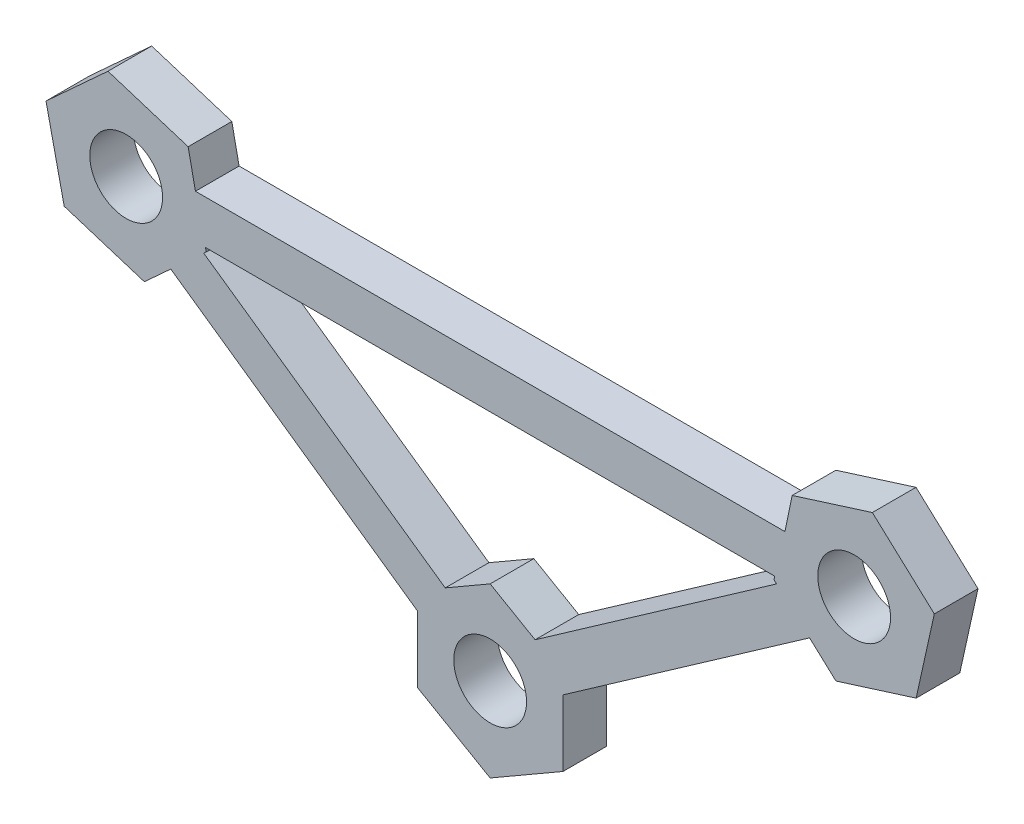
ISO-10303-21;
HEADER;
FILE_DESCRIPTION(('STEP AP214'),'2;1');
FILE_NAME('part.step','',(''),(''),'','','');
FILE_SCHEMA(('AUTOMOTIVE_DESIGN { 1 0 10303 214 1 1 1 1 }'));
ENDSEC;
DATA;
#1=APPLICATION_CONTEXT('core data for automotive mechanical design processes');
#2=APPLICATION_PROTOCOL_DEFINITION('international standard','automotive_design',2000,#1);
#3=PRODUCT_CONTEXT('',#1,'mechanical');
#4=PRODUCT('Part','Part','',(#3));
#5=PRODUCT_RELATED_PRODUCT_CATEGORY('part','',(#4));
#6=PRODUCT_DEFINITION_FORMATION('','',#4);
#7=PRODUCT_DEFINITION_CONTEXT('part definition',#1,'design');
#8=PRODUCT_DEFINITION('design','',#6,#7);
#9=PRODUCT_DEFINITION_SHAPE('','',#8);
#10=(LENGTH_UNIT() NAMED_UNIT(*) SI_UNIT(.MILLI.,.METRE.));
#11=(NAMED_UNIT(*) PLANE_ANGLE_UNIT() SI_UNIT($,.RADIAN.));
#12=(NAMED_UNIT(*) SI_UNIT($,.STERADIAN.) SOLID_ANGLE_UNIT());
#13=UNCERTAINTY_MEASURE_WITH_UNIT(LENGTH_MEASURE(1.E-05),#10,'distance_accuracy_value','');
#14=(GEOMETRIC_REPRESENTATION_CONTEXT(3) GLOBAL_UNCERTAINTY_ASSIGNED_CONTEXT((#13)) GLOBAL_UNIT_ASSIGNED_CONTEXT((#10,
#11,#12)) REPRESENTATION_CONTEXT('',''));
#15=CARTESIAN_POINT('',(0.,0.,0.));
#16=DIRECTION('',(0.,0.,1.));
#17=DIRECTION('',(1.,0.,0.));
#18=AXIS2_PLACEMENT_3D('',#15,#16,#17);
#19=CARTESIAN_POINT('',(-16.8800705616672,-4.00350123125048,1.5));
#20=DIRECTION('',(0.973007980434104,0.230771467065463,0.));
#21=DIRECTION('',(-0.230771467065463,0.973007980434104,0.));
#22=AXIS2_PLACEMENT_3D('',#19,#20,#21);
#23=PLANE('',#22);
#24=DIRECTION('',(0.230771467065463,-0.973007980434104,0.));
#25=VECTOR('',#24,1.);
#26=CARTESIAN_POINT('',(-16.8800705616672,-4.00350123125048,-1.5));
#27=LINE('',#26,#25);
#28=CARTESIAN_POINT('',(-19.5497153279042,7.25259422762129,-1.5));
#29=VERTEX_POINT('',#28);
#30=CARTESIAN_POINT('',(-19.493712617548,7.01646848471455,-1.5));
#31=VERTEX_POINT('',#30);
#32=EDGE_CURVE('E335',#29,#31,#27,.T.);
#33=ORIENTED_EDGE('',*,*,#32,.F.);
#34=DIRECTION('',(0.,0.,-1.));
#35=VECTOR('',#34,1.);
#36=CARTESIAN_POINT('',(-19.5497153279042,7.25259422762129,1.5));
#37=LINE('',#36,#35);
#38=CARTESIAN_POINT('',(-19.5497153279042,7.25259422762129,1.5));
#39=VERTEX_POINT('',#38);
#40=EDGE_CURVE('E11',#39,#29,#37,.T.);
#41=ORIENTED_EDGE('',*,*,#40,.F.);
#42=DIRECTION('',(0.230771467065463,-0.973007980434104,0.));
#43=VECTOR('',#42,1.);
#44=CARTESIAN_POINT('',(-16.8800705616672,-4.00350123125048,1.5));
#45=LINE('',#44,#43);
#46=CARTESIAN_POINT('',(-19.493712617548,7.01646848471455,1.5));
#47=VERTEX_POINT('',#46);
#48=EDGE_CURVE('E416',#39,#47,#45,.T.);
#49=ORIENTED_EDGE('',*,*,#48,.T.);
#50=DIRECTION('',(0.,0.,-1.));
#51=VECTOR('',#50,1.);
#52=CARTESIAN_POINT('',(-19.493712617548,7.01646848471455,1.5));
#53=LINE('',#52,#51);
#54=EDGE_CURVE('E151',#47,#31,#53,.T.);
#55=ORIENTED_EDGE('',*,*,#54,.T.);
#56=EDGE_LOOP('',(#33,#41,#49,#55));
#57=FACE_BOUND('',#56,.T.);
#58=ADVANCED_FACE('F38',(#57),#23,.T.);
#59=CARTESIAN_POINT('',(0.,7.25259422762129,1.5));
#60=DIRECTION('',(0.,-1.,0.));
#61=DIRECTION('',(0.,0.,-1.));
#62=AXIS2_PLACEMENT_3D('',#59,#60,#61);
#63=PLANE('',#62);
#64=DIRECTION('',(-1.,0.,0.));
#65=VECTOR('',#64,1.);
#66=CARTESIAN_POINT('',(0.,7.25259422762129,-1.5));
#67=LINE('',#66,#65);
#68=CARTESIAN_POINT('',(19.546060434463,7.25259422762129,-1.5));
#69=VERTEX_POINT('',#68);
#70=EDGE_CURVE('E332',#69,#29,#67,.T.);
#71=ORIENTED_EDGE('',*,*,#70,.F.);
#72=DIRECTION('',(0.,0.,-1.));
#73=VECTOR('',#72,1.);
#74=CARTESIAN_POINT('',(19.546060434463,7.25259422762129,1.5));
#75=LINE('',#74,#73);
#76=CARTESIAN_POINT('',(19.546060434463,7.25259422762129,1.5));
#77=VERTEX_POINT('',#76);
#78=EDGE_CURVE('E48',#77,#69,#75,.T.);
#79=ORIENTED_EDGE('',*,*,#78,.F.);
#80=DIRECTION('',(-1.,0.,0.));
#81=VECTOR('',#80,1.);
#82=CARTESIAN_POINT('',(0.,7.25259422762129,1.5));
#83=LINE('',#82,#81);
#84=EDGE_CURVE('E413',#77,#39,#83,.T.);
#85=ORIENTED_EDGE('',*,*,#84,.T.);
#86=ORIENTED_EDGE('',*,*,#40,.T.);
#87=EDGE_LOOP('',(#71,#79,#85,#86));
#88=FACE_BOUND('',#87,.T.);
#89=ADVANCED_FACE('F567',(#88),#63,.T.);
#90=CARTESIAN_POINT('',(17.0978642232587,-3.79050524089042,1.5));
#91=DIRECTION('',(-0.97629600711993,0.216439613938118,0.));
#92=DIRECTION('',(-0.216439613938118,-0.97629600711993,0.));
#93=AXIS2_PLACEMENT_3D('',#90,#91,#92);
#94=PLANE('',#93);
#95=DIRECTION('',(0.216439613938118,0.97629600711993,0.));
#96=VECTOR('',#95,1.);
#97=CARTESIAN_POINT('',(17.0978642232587,-3.79050524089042,-1.5));
#98=LINE('',#97,#96);
#99=CARTESIAN_POINT('',(19.493712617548,7.01646848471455,-1.5));
#100=VERTEX_POINT('',#99);
#101=EDGE_CURVE('E329',#100,#69,#98,.T.);
#102=ORIENTED_EDGE('',*,*,#101,.F.);
#103=DIRECTION('',(0.,0.,-1.));
#104=VECTOR('',#103,1.);
#105=CARTESIAN_POINT('',(19.493712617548,7.01646848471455,1.5));
#106=LINE('',#105,#104);
#107=CARTESIAN_POINT('',(19.493712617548,7.01646848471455,1.5));
#108=VERTEX_POINT('',#107);
#109=EDGE_CURVE('E265',#108,#100,#106,.T.);
#110=ORIENTED_EDGE('',*,*,#109,.F.);
#111=DIRECTION('',(0.216439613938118,0.97629600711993,0.));
#112=VECTOR('',#111,1.);
#113=CARTESIAN_POINT('',(17.0978642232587,-3.79050524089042,1.5));
#114=LINE('',#113,#112);
#115=EDGE_CURVE('E410',#108,#77,#114,.T.);
#116=ORIENTED_EDGE('',*,*,#115,.T.);
#117=ORIENTED_EDGE('',*,*,#78,.T.);
#118=EDGE_LOOP('',(#102,#110,#116,#117));
#119=FACE_BOUND('',#118,.T.);
#120=ADVANCED_FACE('F572',(#119),#94,.T.);
#121=CARTESIAN_POINT('',(12.3922461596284,13.5237635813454,1.5));
#122=DIRECTION('',(-0.675590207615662,-0.737277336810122,0.));
#123=DIRECTION('',(0.737277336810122,-0.675590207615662,0.));
#124=AXIS2_PLACEMENT_3D('',#121,#122,#123);
#125=PLANE('',#124);
#126=DIRECTION('',(-0.737277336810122,0.675590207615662,0.));
#127=VECTOR('',#126,1.);
#128=CARTESIAN_POINT('',(12.3922461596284,13.5237635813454,-1.5));
#129=LINE('',#128,#127);
#130=CARTESIAN_POINT('',(19.6720296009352,6.85307107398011,-1.5));
#131=VERTEX_POINT('',#130);
#132=EDGE_CURVE('E326',#131,#100,#129,.T.);
#133=ORIENTED_EDGE('',*,*,#132,.F.);
#134=DIRECTION('',(0.,0.,-1.));
#135=VECTOR('',#134,1.);
#136=CARTESIAN_POINT('',(19.6720296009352,6.85307107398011,1.5));
#137=LINE('',#136,#135);
#138=CARTESIAN_POINT('',(19.6720296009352,6.85307107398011,1.5));
#139=VERTEX_POINT('',#138);
#140=EDGE_CURVE('E263',#139,#131,#137,.T.);
#141=ORIENTED_EDGE('',*,*,#140,.F.);
#142=DIRECTION('',(-0.737277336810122,0.675590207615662,0.));
#143=VECTOR('',#142,1.);
#144=CARTESIAN_POINT('',(12.3922461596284,13.5237635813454,1.5));
#145=LINE('',#144,#143);
#146=EDGE_CURVE('E407',#139,#108,#145,.T.);
#147=ORIENTED_EDGE('',*,*,#146,.T.);
#148=ORIENTED_EDGE('',*,*,#109,.T.);
#149=EDGE_LOOP('',(#133,#141,#147,#148));
#150=FACE_BOUND('',#149,.T.);
#151=ADVANCED_FACE('F578',(#150),#125,.T.);
#152=CARTESIAN_POINT('',(3.25200944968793,-4.64435081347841,1.5));
#153=DIRECTION('',(-0.57357643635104,0.819152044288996,0.));
#154=DIRECTION('',(-0.819152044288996,-0.573576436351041,0.));
#155=AXIS2_PLACEMENT_3D('',#152,#153,#154);
#156=PLANE('',#155);
#157=DIRECTION('',(0.819152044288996,0.573576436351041,0.));
#158=VECTOR('',#157,1.);
#159=CARTESIAN_POINT('',(3.25200944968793,-4.64435081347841,-1.5));
#160=LINE('',#159,#158);
#161=CARTESIAN_POINT('',(3.08584142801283,-4.76070291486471,-1.5));
#162=VERTEX_POINT('',#161);
#163=EDGE_CURVE('E323',#162,#131,#160,.T.);
#164=ORIENTED_EDGE('',*,*,#163,.F.);
#165=DIRECTION('',(0.,0.,-1.));
#166=VECTOR('',#165,1.);
#167=CARTESIAN_POINT('',(3.08584142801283,-4.76070291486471,1.5));
#168=LINE('',#167,#166);
#169=CARTESIAN_POINT('',(3.08584142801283,-4.76070291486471,1.5));
#170=VERTEX_POINT('',#169);
#171=EDGE_CURVE('E257',#170,#162,#168,.T.);
#172=ORIENTED_EDGE('',*,*,#171,.F.);
#173=DIRECTION('',(0.819152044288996,0.573576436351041,0.));
#174=VECTOR('',#173,1.);
#175=CARTESIAN_POINT('',(3.25200944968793,-4.64435081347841,1.5));
#176=LINE('',#175,#174);
#177=EDGE_CURVE('E404',#170,#139,#176,.T.);
#178=ORIENTED_EDGE('',*,*,#177,.T.);
#179=ORIENTED_EDGE('',*,*,#140,.T.);
#180=EDGE_LOOP('',(#164,#172,#178,#179));
#181=FACE_BOUND('',#180,.T.);
#182=ADVANCED_FACE('F582',(#181),#156,.T.);
#183=CARTESIAN_POINT('',(-1.28998447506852,-2.23431865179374,1.5));
#184=DIRECTION('',(0.500000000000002,0.866025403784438,0.));
#185=DIRECTION('',(-0.866025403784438,0.500000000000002,0.));
#186=AXIS2_PLACEMENT_3D('',#183,#184,#185);
#187=PLANE('',#186);
#188=DIRECTION('',(0.866025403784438,-0.500000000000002,0.));
#189=VECTOR('',#188,1.);
#190=CARTESIAN_POINT('',(-1.28998447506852,-2.23431865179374,-1.5));
#191=LINE('',#190,#189);
#192=CARTESIAN_POINT('',(0.,-2.979091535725,-1.5));
#193=VERTEX_POINT('',#192);
#194=EDGE_CURVE('E320',#193,#162,#191,.T.);
#195=ORIENTED_EDGE('',*,*,#194,.F.);
#196=DIRECTION('',(0.,0.,-1.));
#197=VECTOR('',#196,1.);
#198=CARTESIAN_POINT('',(0.,-2.979091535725,1.5));
#199=LINE('',#198,#197);
#200=CARTESIAN_POINT('',(0.,-2.979091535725,1.5));
#201=VERTEX_POINT('',#200);
#202=EDGE_CURVE('E255',#201,#193,#199,.T.);
#203=ORIENTED_EDGE('',*,*,#202,.F.);
#204=DIRECTION('',(0.866025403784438,-0.500000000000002,0.));
#205=VECTOR('',#204,1.);
#206=CARTESIAN_POINT('',(-1.28998447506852,-2.23431865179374,1.5));
#207=LINE('',#206,#205);
#208=EDGE_CURVE('E249',#201,#170,#207,.T.);
#209=ORIENTED_EDGE('',*,*,#208,.T.);
#210=ORIENTED_EDGE('',*,*,#171,.T.);
#211=EDGE_LOOP('',(#195,#203,#209,#210));
#212=FACE_BOUND('',#211,.T.);
#213=ADVANCED_FACE('F586',(#212),#187,.T.);
#214=CARTESIAN_POINT('',(1.28998447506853,-2.23431865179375,1.5));
#215=DIRECTION('',(0.5,-0.866025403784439,0.));
#216=DIRECTION('',(0.866025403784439,0.5,0.));
#217=AXIS2_PLACEMENT_3D('',#214,#215,#216);
#218=PLANE('',#217);
#219=DIRECTION('',(-0.866025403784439,-0.5,0.));
#220=VECTOR('',#219,1.);
#221=CARTESIAN_POINT('',(1.28998447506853,-2.23431865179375,-1.5));
#222=LINE('',#221,#220);
#223=CARTESIAN_POINT('',(-3.08584142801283,-4.76070291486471,-1.5));
#224=VERTEX_POINT('',#223);
#225=EDGE_CURVE('E254',#193,#224,#222,.T.);
#226=ORIENTED_EDGE('',*,*,#225,.T.);
#227=DIRECTION('',(0.,0.,-1.));
#228=VECTOR('',#227,1.);
#229=CARTESIAN_POINT('',(-3.08584142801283,-4.76070291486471,1.5));
#230=LINE('',#229,#228);
#231=CARTESIAN_POINT('',(-3.08584142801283,-4.76070291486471,1.5));
#232=VERTEX_POINT('',#231);
#233=EDGE_CURVE('E239',#232,#224,#230,.T.);
#234=ORIENTED_EDGE('',*,*,#233,.F.);
#235=DIRECTION('',(-0.866025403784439,-0.5,0.));
#236=VECTOR('',#235,1.);
#237=CARTESIAN_POINT('',(1.28998447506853,-2.23431865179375,1.5));
#238=LINE('',#237,#236);
#239=EDGE_CURVE('E242',#201,#232,#238,.T.);
#240=ORIENTED_EDGE('',*,*,#239,.F.);
#241=ORIENTED_EDGE('',*,*,#202,.T.);
#242=EDGE_LOOP('',(#226,#234,#240,#241));
#243=FACE_BOUND('',#242,.T.);
#244=ADVANCED_FACE('F252',(#243),#218,.F.);
#245=CARTESIAN_POINT('',(-3.25200944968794,-4.64435081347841,1.5));
#246=DIRECTION('',(-0.573576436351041,-0.819152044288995,0.));
#247=DIRECTION('',(0.819152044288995,-0.573576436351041,0.));
#248=AXIS2_PLACEMENT_3D('',#245,#246,#247);
#249=PLANE('',#248);
#250=DIRECTION('',(-0.819152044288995,0.573576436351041,0.));
#251=VECTOR('',#250,1.);
#252=CARTESIAN_POINT('',(-3.25200944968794,-4.64435081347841,-1.5));
#253=LINE('',#252,#251);
#254=CARTESIAN_POINT('',(-19.6720296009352,6.85307107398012,-1.5));
#255=VERTEX_POINT('',#254);
#256=EDGE_CURVE('E317',#224,#255,#253,.T.);
#257=ORIENTED_EDGE('',*,*,#256,.T.);
#258=DIRECTION('',(0.,0.,-1.));
#259=VECTOR('',#258,1.);
#260=CARTESIAN_POINT('',(-19.6720296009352,6.85307107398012,1.5));
#261=LINE('',#260,#259);
#262=CARTESIAN_POINT('',(-19.6720296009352,6.85307107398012,1.5));
#263=VERTEX_POINT('',#262);
#264=EDGE_CURVE('E241',#263,#255,#261,.T.);
#265=ORIENTED_EDGE('',*,*,#264,.F.);
#266=DIRECTION('',(-0.819152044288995,0.573576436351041,0.));
#267=VECTOR('',#266,1.);
#268=CARTESIAN_POINT('',(-3.25200944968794,-4.64435081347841,1.5));
#269=LINE('',#268,#267);
#270=EDGE_CURVE('E234',#232,#263,#269,.T.);
#271=ORIENTED_EDGE('',*,*,#270,.F.);
#272=ORIENTED_EDGE('',*,*,#233,.T.);
#273=EDGE_LOOP('',(#257,#265,#271,#272));
#274=FACE_BOUND('',#273,.T.);
#275=ADVANCED_FACE('F237',(#274),#249,.F.);
#276=CARTESIAN_POINT('',(5.,0.,1.5));
#277=DIRECTION('',(1.,0.,0.));
#278=DIRECTION('',(0.,1.,0.));
#279=AXIS2_PLACEMENT_3D('',#276,#277,#278);
#280=PLANE('',#279);
#281=DIRECTION('',(0.,-1.,0.));
#282=VECTOR('',#281,1.);
#283=CARTESIAN_POINT('',(5.,0.,-1.5));
#284=LINE('',#283,#282);
#285=CARTESIAN_POINT('',(5.,-7.08271841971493,-1.5));
#286=VERTEX_POINT('',#285);
#287=CARTESIAN_POINT('',(5.,-11.6393455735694,-1.5));
#288=VERTEX_POINT('',#287);
#289=EDGE_CURVE('E390',#286,#288,#284,.T.);
#290=ORIENTED_EDGE('',*,*,#289,.F.);
#291=DIRECTION('',(0.,0.,-1.));
#292=VECTOR('',#291,1.);
#293=CARTESIAN_POINT('',(5.,-7.08271841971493,1.5));
#294=LINE('',#293,#292);
#295=CARTESIAN_POINT('',(5.,-7.08271841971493,1.5));
#296=VERTEX_POINT('',#295);
#297=EDGE_CURVE('E42',#296,#286,#294,.T.);
#298=ORIENTED_EDGE('',*,*,#297,.F.);
#299=DIRECTION('',(0.,-1.,0.));
#300=VECTOR('',#299,1.);
#301=CARTESIAN_POINT('',(5.,0.,1.5));
#302=LINE('',#301,#300);
#303=CARTESIAN_POINT('',(5.,-11.6393455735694,1.5));
#304=VERTEX_POINT('',#303);
#305=EDGE_CURVE('E468',#296,#304,#302,.T.);
#306=ORIENTED_EDGE('',*,*,#305,.T.);
#307=DIRECTION('',(0.,0.,-1.));
#308=VECTOR('',#307,1.);
#309=CARTESIAN_POINT('',(5.,-11.6393455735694,1.5));
#310=LINE('',#309,#308);
#311=EDGE_CURVE('E268',#304,#288,#310,.T.);
#312=ORIENTED_EDGE('',*,*,#311,.T.);
#313=EDGE_LOOP('',(#290,#298,#306,#312));
#314=FACE_BOUND('',#313,.T.);
#315=ADVANCED_FACE('F493',(#314),#280,.T.);
#316=CARTESIAN_POINT('',(4.97273875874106,-7.10180694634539,1.5));
#317=DIRECTION('',(-0.573576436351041,0.819152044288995,0.));
#318=DIRECTION('',(-0.819152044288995,-0.573576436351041,0.));
#319=AXIS2_PLACEMENT_3D('',#316,#317,#318);
#320=PLANE('',#319);
#321=DIRECTION('',(0.819152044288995,0.573576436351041,0.));
#322=VECTOR('',#321,1.);
#323=CARTESIAN_POINT('',(4.97273875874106,-7.10180694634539,-1.5));
#324=LINE('',#323,#322);
#325=CARTESIAN_POINT('',(21.9375638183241,4.7770914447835,-1.5));
#326=VERTEX_POINT('',#325);
#327=EDGE_CURVE('E388',#286,#326,#324,.T.);
#328=ORIENTED_EDGE('',*,*,#327,.T.);
#329=DIRECTION('',(0.,0.,-1.));
#330=VECTOR('',#329,1.);
#331=CARTESIAN_POINT('',(21.9375638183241,4.7770914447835,1.5));
#332=LINE('',#331,#330);
#333=CARTESIAN_POINT('',(21.9375638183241,4.7770914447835,1.5));
#334=VERTEX_POINT('',#333);
#335=EDGE_CURVE('E306',#334,#326,#332,.T.);
#336=ORIENTED_EDGE('',*,*,#335,.F.);
#337=DIRECTION('',(0.819152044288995,0.573576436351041,0.));
#338=VECTOR('',#337,1.);
#339=CARTESIAN_POINT('',(4.97273875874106,-7.10180694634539,1.5));
#340=LINE('',#339,#338);
#341=EDGE_CURVE('E466',#296,#334,#340,.T.);
#342=ORIENTED_EDGE('',*,*,#341,.F.);
#343=ORIENTED_EDGE('',*,*,#297,.T.);
#344=EDGE_LOOP('',(#328,#336,#342,#343));
#345=FACE_BOUND('',#344,.T.);
#346=ADVANCED_FACE('F499',(#345),#320,.F.);
#347=CARTESIAN_POINT('',(12.3922461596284,13.5237635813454,1.5));
#348=DIRECTION('',(-0.675590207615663,-0.737277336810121,0.));
#349=DIRECTION('',(0.737277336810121,-0.675590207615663,0.));
#350=AXIS2_PLACEMENT_3D('',#347,#348,#349);
#351=PLANE('',#350);
#352=DIRECTION('',(-0.737277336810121,0.675590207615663,0.));
#353=VECTOR('',#352,1.);
#354=CARTESIAN_POINT('',(12.3922461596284,13.5237635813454,-1.5));
#355=LINE('',#354,#353);
#356=CARTESIAN_POINT('',(23.7503853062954,3.11594660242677,-1.5));
#357=VERTEX_POINT('',#356);
#358=EDGE_CURVE('E385',#357,#326,#355,.T.);
#359=ORIENTED_EDGE('',*,*,#358,.F.);
#360=DIRECTION('',(0.,0.,-1.));
#361=VECTOR('',#360,1.);
#362=CARTESIAN_POINT('',(23.7503853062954,3.11594660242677,1.5));
#363=LINE('',#362,#361);
#364=CARTESIAN_POINT('',(23.7503853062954,3.11594660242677,1.5));
#365=VERTEX_POINT('',#364);
#366=EDGE_CURVE('E305',#365,#357,#363,.T.);
#367=ORIENTED_EDGE('',*,*,#366,.F.);
#368=DIRECTION('',(-0.737277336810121,0.675590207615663,0.));
#369=VECTOR('',#368,1.);
#370=CARTESIAN_POINT('',(12.3922461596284,13.5237635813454,1.5));
#371=LINE('',#370,#369);
#372=EDGE_CURVE('E464',#365,#334,#371,.T.);
#373=ORIENTED_EDGE('',*,*,#372,.T.);
#374=ORIENTED_EDGE('',*,*,#335,.T.);
#375=EDGE_LOOP('',(#359,#367,#373,#374));
#376=FACE_BOUND('',#375,.T.);
#377=ADVANCED_FACE('F500',(#376),#351,.T.);
#378=CARTESIAN_POINT('',(1.25398754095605,-3.9771403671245,1.5));
#379=DIRECTION('',(0.30070579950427,-0.953716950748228,0.));
#380=DIRECTION('',(0.953716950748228,0.30070579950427,0.));
#381=AXIS2_PLACEMENT_3D('',#378,#379,#380);
#382=PLANE('',#381);
#383=DIRECTION('',(-0.953716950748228,-0.30070579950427,0.));
#384=VECTOR('',#383,1.);
#385=CARTESIAN_POINT('',(1.25398754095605,-3.9771403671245,-1.5));
#386=LINE('',#385,#384);
#387=CARTESIAN_POINT('',(29.2566726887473,4.85207234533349,-1.5));
#388=VERTEX_POINT('',#387);
#389=EDGE_CURVE('E382',#388,#357,#386,.T.);
#390=ORIENTED_EDGE('',*,*,#389,.F.);
#391=DIRECTION('',(0.,0.,-1.));
#392=VECTOR('',#391,1.);
#393=CARTESIAN_POINT('',(29.2566726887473,4.85207234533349,1.5));
#394=LINE('',#393,#392);
#395=CARTESIAN_POINT('',(29.2566726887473,4.85207234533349,1.5));
#396=VERTEX_POINT('',#395);
#397=EDGE_CURVE('E303',#396,#388,#394,.T.);
#398=ORIENTED_EDGE('',*,*,#397,.F.);
#399=DIRECTION('',(-0.953716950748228,-0.30070579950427,0.));
#400=VECTOR('',#399,1.);
#401=CARTESIAN_POINT('',(1.25398754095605,-3.9771403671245,1.5));
#402=LINE('',#401,#400);
#403=EDGE_CURVE('E461',#396,#365,#402,.T.);
#404=ORIENTED_EDGE('',*,*,#403,.T.);
#405=ORIENTED_EDGE('',*,*,#366,.T.);
#406=EDGE_LOOP('',(#390,#398,#404,#405));
#407=FACE_BOUND('',#406,.T.);
#408=ADVANCED_FACE('F505',(#407),#382,.T.);
#409=CARTESIAN_POINT('',(26.8608242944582,-5.9549013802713,1.5));
#410=DIRECTION('',(0.976296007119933,-0.216439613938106,0.));
#411=DIRECTION('',(0.216439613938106,0.976296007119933,0.));
#412=AXIS2_PLACEMENT_3D('',#409,#410,#411);
#413=PLANE('',#412);
#414=DIRECTION('',(-0.216439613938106,-0.976296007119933,0.));
#415=VECTOR('',#414,1.);
#416=CARTESIAN_POINT('',(26.8608242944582,-5.9549013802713,-1.5));
#417=LINE('',#416,#415);
#418=CARTESIAN_POINT('',(30.506287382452,10.488719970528,-1.5));
#419=VERTEX_POINT('',#418);
#420=EDGE_CURVE('E379',#419,#388,#417,.T.);
#421=ORIENTED_EDGE('',*,*,#420,.F.);
#422=DIRECTION('',(0.,0.,-1.));
#423=VECTOR('',#422,1.);
#424=CARTESIAN_POINT('',(30.506287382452,10.488719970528,1.5));
#425=LINE('',#424,#423);
#426=CARTESIAN_POINT('',(30.506287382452,10.488719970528,1.5));
#427=VERTEX_POINT('',#426);
#428=EDGE_CURVE('E301',#427,#419,#425,.T.);
#429=ORIENTED_EDGE('',*,*,#428,.F.);
#430=DIRECTION('',(-0.216439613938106,-0.976296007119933,0.));
#431=VECTOR('',#430,1.);
#432=CARTESIAN_POINT('',(26.8608242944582,-5.9549013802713,1.5));
#433=LINE('',#432,#431);
#434=EDGE_CURVE('E458',#427,#396,#433,.T.);
#435=ORIENTED_EDGE('',*,*,#434,.T.);
#436=ORIENTED_EDGE('',*,*,#397,.T.);
#437=EDGE_LOOP('',(#421,#429,#435,#436));
#438=FACE_BOUND('',#437,.T.);
#439=ADVANCED_FACE('F508',(#438),#413,.T.);
#440=CARTESIAN_POINT('',(19.148148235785,20.8965369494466,1.5));
#441=DIRECTION('',(0.675590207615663,0.737277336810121,0.));
#442=DIRECTION('',(-0.737277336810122,0.675590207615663,0.));
#443=AXIS2_PLACEMENT_3D('',#440,#441,#442);
#444=PLANE('',#443);
#445=DIRECTION('',(0.737277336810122,-0.675590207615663,0.));
#446=VECTOR('',#445,1.);
#447=CARTESIAN_POINT('',(19.148148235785,20.8965369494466,-1.5));
#448=LINE('',#447,#446);
#449=CARTESIAN_POINT('',(26.2496146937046,14.3892418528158,-1.5));
#450=VERTEX_POINT('',#449);
#451=EDGE_CURVE('E376',#450,#419,#448,.T.);
#452=ORIENTED_EDGE('',*,*,#451,.F.);
#453=DIRECTION('',(0.,0.,-1.));
#454=VECTOR('',#453,1.);
#455=CARTESIAN_POINT('',(26.2496146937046,14.3892418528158,1.5));
#456=LINE('',#455,#454);
#457=CARTESIAN_POINT('',(26.2496146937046,14.3892418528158,1.5));
#458=VERTEX_POINT('',#457);
#459=EDGE_CURVE('E299',#458,#450,#456,.T.);
#460=ORIENTED_EDGE('',*,*,#459,.F.);
#461=DIRECTION('',(0.737277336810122,-0.675590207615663,0.));
#462=VECTOR('',#461,1.);
#463=CARTESIAN_POINT('',(19.148148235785,20.8965369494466,1.5));
#464=LINE('',#463,#462);
#465=EDGE_CURVE('E455',#458,#427,#464,.T.);
#466=ORIENTED_EDGE('',*,*,#465,.T.);
#467=ORIENTED_EDGE('',*,*,#428,.T.);
#468=EDGE_LOOP('',(#452,#460,#466,#467));
#469=FACE_BOUND('',#468,.T.);
#470=ADVANCED_FACE('F513',(#469),#444,.T.);
#471=CARTESIAN_POINT('',(-1.75307045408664,5.56002914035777,1.5));
#472=DIRECTION('',(-0.30070579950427,0.953716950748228,0.));
#473=DIRECTION('',(-0.953716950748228,-0.30070579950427,0.));
#474=AXIS2_PLACEMENT_3D('',#471,#472,#473);
#475=PLANE('',#474);
#476=DIRECTION('',(0.953716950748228,0.30070579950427,0.));
#477=VECTOR('',#476,1.);
#478=CARTESIAN_POINT('',(-1.75307045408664,5.56002914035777,-1.5));
#479=LINE('',#478,#477);
#480=CARTESIAN_POINT('',(20.7433273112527,12.653116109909,-1.5));
#481=VERTEX_POINT('',#480);
#482=EDGE_CURVE('E373',#481,#450,#479,.T.);
#483=ORIENTED_EDGE('',*,*,#482,.F.);
#484=DIRECTION('',(0.,0.,-1.));
#485=VECTOR('',#484,1.);
#486=CARTESIAN_POINT('',(20.7433273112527,12.653116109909,1.5));
#487=LINE('',#486,#485);
#488=CARTESIAN_POINT('',(20.7433273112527,12.653116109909,1.5));
#489=VERTEX_POINT('',#488);
#490=EDGE_CURVE('E297',#489,#481,#487,.T.);
#491=ORIENTED_EDGE('',*,*,#490,.F.);
#492=DIRECTION('',(0.953716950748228,0.30070579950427,0.));
#493=VECTOR('',#492,1.);
#494=CARTESIAN_POINT('',(-1.75307045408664,5.56002914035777,1.5));
#495=LINE('',#494,#493);
#496=EDGE_CURVE('E452',#489,#458,#495,.T.);
#497=ORIENTED_EDGE('',*,*,#496,.T.);
#498=ORIENTED_EDGE('',*,*,#459,.T.);
#499=EDGE_LOOP('',(#483,#491,#497,#498));
#500=FACE_BOUND('',#499,.T.);
#501=ADVANCED_FACE('F516',(#500),#475,.T.);
#502=CARTESIAN_POINT('',(17.3491981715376,-3.61883061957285,1.5));
#503=DIRECTION('',(-0.978930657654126,0.204192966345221,0.));
#504=DIRECTION('',(-0.204192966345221,-0.978930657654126,0.));
#505=AXIS2_PLACEMENT_3D('',#502,#503,#504);
#506=PLANE('',#505);
#507=DIRECTION('',(0.204192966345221,0.978930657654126,0.));
#508=VECTOR('',#507,1.);
#509=CARTESIAN_POINT('',(17.3491981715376,-3.61883061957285,-1.5));
#510=LINE('',#509,#508);
#511=CARTESIAN_POINT('',(20.2426077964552,10.2525942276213,-1.5));
#512=VERTEX_POINT('',#511);
#513=EDGE_CURVE('E370',#512,#481,#510,.T.);
#514=ORIENTED_EDGE('',*,*,#513,.F.);
#515=DIRECTION('',(0.,0.,-1.));
#516=VECTOR('',#515,1.);
#517=CARTESIAN_POINT('',(20.2426077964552,10.2525942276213,1.5));
#518=LINE('',#517,#516);
#519=CARTESIAN_POINT('',(20.2426077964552,10.2525942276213,1.5));
#520=VERTEX_POINT('',#519);
#521=EDGE_CURVE('E295',#520,#512,#518,.T.);
#522=ORIENTED_EDGE('',*,*,#521,.F.);
#523=DIRECTION('',(0.204192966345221,0.978930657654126,0.));
#524=VECTOR('',#523,1.);
#525=CARTESIAN_POINT('',(17.3491981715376,-3.61883061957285,1.5));
#526=LINE('',#525,#524);
#527=EDGE_CURVE('E449',#520,#489,#526,.T.);
#528=ORIENTED_EDGE('',*,*,#527,.T.);
#529=ORIENTED_EDGE('',*,*,#490,.T.);
#530=EDGE_LOOP('',(#514,#522,#528,#529));
#531=FACE_BOUND('',#530,.T.);
#532=ADVANCED_FACE('F521',(#531),#506,.T.);
#533=CARTESIAN_POINT('',(0.,10.2525942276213,1.5));
#534=DIRECTION('',(0.,1.,0.));
#535=DIRECTION('',(-1.,0.,0.));
#536=AXIS2_PLACEMENT_3D('',#533,#534,#535);
#537=PLANE('',#536);
#538=DIRECTION('',(1.,0.,0.));
#539=VECTOR('',#538,1.);
#540=CARTESIAN_POINT('',(0.,10.2525942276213,-1.5));
#541=LINE('',#540,#539);
#542=CARTESIAN_POINT('',(-20.2426077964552,10.2525942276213,-1.5));
#543=VERTEX_POINT('',#542);
#544=EDGE_CURVE('E367',#543,#512,#541,.T.);
#545=ORIENTED_EDGE('',*,*,#544,.F.);
#546=DIRECTION('',(0.,0.,-1.));
#547=VECTOR('',#546,1.);
#548=CARTESIAN_POINT('',(-20.2426077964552,10.2525942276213,1.5));
#549=LINE('',#548,#547);
#550=CARTESIAN_POINT('',(-20.2426077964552,10.2525942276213,1.5));
#551=VERTEX_POINT('',#550);
#552=EDGE_CURVE('E293',#551,#543,#549,.T.);
#553=ORIENTED_EDGE('',*,*,#552,.F.);
#554=DIRECTION('',(1.,0.,0.));
#555=VECTOR('',#554,1.);
#556=CARTESIAN_POINT('',(0.,10.2525942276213,1.5));
#557=LINE('',#556,#555);
#558=EDGE_CURVE('E446',#551,#520,#557,.T.);
#559=ORIENTED_EDGE('',*,*,#558,.T.);
#560=ORIENTED_EDGE('',*,*,#521,.T.);
#561=EDGE_LOOP('',(#545,#553,#559,#560));
#562=FACE_BOUND('',#561,.T.);
#563=ADVANCED_FACE('F524',(#562),#537,.T.);
#564=CARTESIAN_POINT('',(-17.3491981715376,-3.61883061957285,1.5));
#565=DIRECTION('',(0.978930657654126,0.204192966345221,0.));
#566=DIRECTION('',(-0.204192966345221,0.978930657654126,0.));
#567=AXIS2_PLACEMENT_3D('',#564,#565,#566);
#568=PLANE('',#567);
#569=DIRECTION('',(0.204192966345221,-0.978930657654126,0.));
#570=VECTOR('',#569,1.);
#571=CARTESIAN_POINT('',(-17.3491981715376,-3.61883061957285,-1.5));
#572=LINE('',#571,#570);
#573=CARTESIAN_POINT('',(-20.7433273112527,12.653116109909,-1.5));
#574=VERTEX_POINT('',#573);
#575=EDGE_CURVE('E364',#574,#543,#572,.T.);
#576=ORIENTED_EDGE('',*,*,#575,.F.);
#577=DIRECTION('',(0.,0.,-1.));
#578=VECTOR('',#577,1.);
#579=CARTESIAN_POINT('',(-20.7433273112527,12.653116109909,1.5));
#580=LINE('',#579,#578);
#581=CARTESIAN_POINT('',(-20.7433273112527,12.653116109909,1.5));
#582=VERTEX_POINT('',#581);
#583=EDGE_CURVE('E291',#582,#574,#580,.T.);
#584=ORIENTED_EDGE('',*,*,#583,.F.);
#585=DIRECTION('',(0.204192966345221,-0.978930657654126,0.));
#586=VECTOR('',#585,1.);
#587=CARTESIAN_POINT('',(-17.3491981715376,-3.61883061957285,1.5));
#588=LINE('',#587,#586);
#589=EDGE_CURVE('E443',#582,#551,#588,.T.);
#590=ORIENTED_EDGE('',*,*,#589,.T.);
#591=ORIENTED_EDGE('',*,*,#552,.T.);
#592=EDGE_LOOP('',(#576,#584,#590,#591));
#593=FACE_BOUND('',#592,.T.);
#594=ADVANCED_FACE('F528',(#593),#568,.T.);
#595=CARTESIAN_POINT('',(1.75307045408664,5.56002914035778,1.5));
#596=DIRECTION('',(-0.30070579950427,-0.953716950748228,0.));
#597=DIRECTION('',(0.953716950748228,-0.30070579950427,0.));
#598=AXIS2_PLACEMENT_3D('',#595,#596,#597);
#599=PLANE('',#598);
#600=DIRECTION('',(-0.953716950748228,0.30070579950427,0.));
#601=VECTOR('',#600,1.);
#602=CARTESIAN_POINT('',(1.75307045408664,5.56002914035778,-1.5));
#603=LINE('',#602,#601);
#604=CARTESIAN_POINT('',(-26.2496146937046,14.3892418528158,-1.5));
#605=VERTEX_POINT('',#604);
#606=EDGE_CURVE('E361',#574,#605,#603,.T.);
#607=ORIENTED_EDGE('',*,*,#606,.T.);
#608=DIRECTION('',(0.,0.,-1.));
#609=VECTOR('',#608,1.);
#610=CARTESIAN_POINT('',(-26.2496146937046,14.3892418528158,1.5));
#611=LINE('',#610,#609);
#612=CARTESIAN_POINT('',(-26.2496146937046,14.3892418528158,1.5));
#613=VERTEX_POINT('',#612);
#614=EDGE_CURVE('E288',#613,#605,#611,.T.);
#615=ORIENTED_EDGE('',*,*,#614,.F.);
#616=DIRECTION('',(-0.953716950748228,0.30070579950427,0.));
#617=VECTOR('',#616,1.);
#618=CARTESIAN_POINT('',(1.75307045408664,5.56002914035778,1.5));
#619=LINE('',#618,#617);
#620=EDGE_CURVE('E440',#582,#613,#619,.T.);
#621=ORIENTED_EDGE('',*,*,#620,.F.);
#622=ORIENTED_EDGE('',*,*,#583,.T.);
#623=EDGE_LOOP('',(#607,#615,#621,#622));
#624=FACE_BOUND('',#623,.T.);
#625=ADVANCED_FACE('F533',(#624),#599,.F.);
#626=CARTESIAN_POINT('',(-19.148148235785,20.8965369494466,1.5));
#627=DIRECTION('',(0.675590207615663,-0.737277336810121,0.));
#628=DIRECTION('',(0.737277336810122,0.675590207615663,0.));
#629=AXIS2_PLACEMENT_3D('',#626,#627,#628);
#630=PLANE('',#629);
#631=DIRECTION('',(-0.737277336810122,-0.675590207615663,0.));
#632=VECTOR('',#631,1.);
#633=CARTESIAN_POINT('',(-19.148148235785,20.8965369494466,-1.5));
#634=LINE('',#633,#632);
#635=CARTESIAN_POINT('',(-30.506287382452,10.488719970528,-1.5));
#636=VERTEX_POINT('',#635);
#637=EDGE_CURVE('E358',#605,#636,#634,.T.);
#638=ORIENTED_EDGE('',*,*,#637,.T.);
#639=DIRECTION('',(0.,0.,-1.));
#640=VECTOR('',#639,1.);
#641=CARTESIAN_POINT('',(-30.506287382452,10.488719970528,1.5));
#642=LINE('',#641,#640);
#643=CARTESIAN_POINT('',(-30.506287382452,10.488719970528,1.5));
#644=VERTEX_POINT('',#643);
#645=EDGE_CURVE('E285',#644,#636,#642,.T.);
#646=ORIENTED_EDGE('',*,*,#645,.F.);
#647=DIRECTION('',(-0.737277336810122,-0.675590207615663,0.));
#648=VECTOR('',#647,1.);
#649=CARTESIAN_POINT('',(-19.148148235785,20.8965369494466,1.5));
#650=LINE('',#649,#648);
#651=EDGE_CURVE('E437',#613,#644,#650,.T.);
#652=ORIENTED_EDGE('',*,*,#651,.F.);
#653=ORIENTED_EDGE('',*,*,#614,.T.);
#654=EDGE_LOOP('',(#638,#646,#652,#653));
#655=FACE_BOUND('',#654,.T.);
#656=ADVANCED_FACE('F537',(#655),#630,.F.);
#657=CARTESIAN_POINT('',(-26.8608242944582,-5.95490138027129,1.5));
#658=DIRECTION('',(0.976296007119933,0.216439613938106,0.));
#659=DIRECTION('',(-0.216439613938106,0.976296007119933,0.));
#660=AXIS2_PLACEMENT_3D('',#657,#658,#659);
#661=PLANE('',#660);
#662=DIRECTION('',(0.216439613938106,-0.976296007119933,0.));
#663=VECTOR('',#662,1.);
#664=CARTESIAN_POINT('',(-26.8608242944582,-5.95490138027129,-1.5));
#665=LINE('',#664,#663);
#666=CARTESIAN_POINT('',(-29.2566726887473,4.85207234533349,-1.5));
#667=VERTEX_POINT('',#666);
#668=EDGE_CURVE('E355',#636,#667,#665,.T.);
#669=ORIENTED_EDGE('',*,*,#668,.T.);
#670=DIRECTION('',(0.,0.,-1.));
#671=VECTOR('',#670,1.);
#672=CARTESIAN_POINT('',(-29.2566726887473,4.85207234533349,1.5));
#673=LINE('',#672,#671);
#674=CARTESIAN_POINT('',(-29.2566726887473,4.85207234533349,1.5));
#675=VERTEX_POINT('',#674);
#676=EDGE_CURVE('E282',#675,#667,#673,.T.);
#677=ORIENTED_EDGE('',*,*,#676,.F.);
#678=DIRECTION('',(0.216439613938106,-0.976296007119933,0.));
#679=VECTOR('',#678,1.);
#680=CARTESIAN_POINT('',(-26.8608242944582,-5.95490138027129,1.5));
#681=LINE('',#680,#679);
#682=EDGE_CURVE('E434',#644,#675,#681,.T.);
#683=ORIENTED_EDGE('',*,*,#682,.F.);
#684=ORIENTED_EDGE('',*,*,#645,.T.);
#685=EDGE_LOOP('',(#669,#677,#683,#684));
#686=FACE_BOUND('',#685,.T.);
#687=ADVANCED_FACE('F539',(#686),#661,.F.);
#688=CARTESIAN_POINT('',(-1.25398754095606,-3.9771403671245,1.5));
#689=DIRECTION('',(0.30070579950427,0.953716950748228,0.));
#690=DIRECTION('',(-0.953716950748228,0.30070579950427,0.));
#691=AXIS2_PLACEMENT_3D('',#688,#689,#690);
#692=PLANE('',#691);
#693=DIRECTION('',(0.953716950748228,-0.30070579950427,0.));
#694=VECTOR('',#693,1.);
#695=CARTESIAN_POINT('',(-1.25398754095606,-3.9771403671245,-1.5));
#696=LINE('',#695,#694);
#697=CARTESIAN_POINT('',(-23.7503853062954,3.11594660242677,-1.5));
#698=VERTEX_POINT('',#697);
#699=EDGE_CURVE('E352',#667,#698,#696,.T.);
#700=ORIENTED_EDGE('',*,*,#699,.T.);
#701=DIRECTION('',(0.,0.,-1.));
#702=VECTOR('',#701,1.);
#703=CARTESIAN_POINT('',(-23.7503853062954,3.11594660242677,1.5));
#704=LINE('',#703,#702);
#705=CARTESIAN_POINT('',(-23.7503853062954,3.11594660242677,1.5));
#706=VERTEX_POINT('',#705);
#707=EDGE_CURVE('E279',#706,#698,#704,.T.);
#708=ORIENTED_EDGE('',*,*,#707,.F.);
#709=DIRECTION('',(0.953716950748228,-0.30070579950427,0.));
#710=VECTOR('',#709,1.);
#711=CARTESIAN_POINT('',(-1.25398754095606,-3.9771403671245,1.5));
#712=LINE('',#711,#710);
#713=EDGE_CURVE('E431',#675,#706,#712,.T.);
#714=ORIENTED_EDGE('',*,*,#713,.F.);
#715=ORIENTED_EDGE('',*,*,#676,.T.);
#716=EDGE_LOOP('',(#700,#708,#714,#715));
#717=FACE_BOUND('',#716,.T.);
#718=ADVANCED_FACE('F541',(#717),#692,.F.);
#719=CARTESIAN_POINT('',(-12.3922461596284,13.5237635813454,1.5));
#720=DIRECTION('',(-0.675590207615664,0.737277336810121,0.));
#721=DIRECTION('',(-0.737277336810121,-0.675590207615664,0.));
#722=AXIS2_PLACEMENT_3D('',#719,#720,#721);
#723=PLANE('',#722);
#724=DIRECTION('',(0.737277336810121,0.675590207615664,0.));
#725=VECTOR('',#724,1.);
#726=CARTESIAN_POINT('',(-12.3922461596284,13.5237635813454,-1.5));
#727=LINE('',#726,#725);
#728=CARTESIAN_POINT('',(-21.9375638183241,4.77709144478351,-1.5));
#729=VERTEX_POINT('',#728);
#730=EDGE_CURVE('E349',#698,#729,#727,.T.);
#731=ORIENTED_EDGE('',*,*,#730,.T.);
#732=DIRECTION('',(0.,0.,-1.));
#733=VECTOR('',#732,1.);
#734=CARTESIAN_POINT('',(-21.9375638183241,4.77709144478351,1.5));
#735=LINE('',#734,#733);
#736=CARTESIAN_POINT('',(-21.9375638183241,4.77709144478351,1.5));
#737=VERTEX_POINT('',#736);
#738=EDGE_CURVE('E277',#737,#729,#735,.T.);
#739=ORIENTED_EDGE('',*,*,#738,.F.);
#740=DIRECTION('',(0.737277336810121,0.675590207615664,0.));
#741=VECTOR('',#740,1.);
#742=CARTESIAN_POINT('',(-12.3922461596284,13.5237635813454,1.5));
#743=LINE('',#742,#741);
#744=EDGE_CURVE('E429',#706,#737,#743,.T.);
#745=ORIENTED_EDGE('',*,*,#744,.F.);
#746=ORIENTED_EDGE('',*,*,#707,.T.);
#747=EDGE_LOOP('',(#731,#739,#745,#746));
#748=FACE_BOUND('',#747,.T.);
#749=ADVANCED_FACE('F547',(#748),#723,.F.);
#750=CARTESIAN_POINT('',(-4.97273875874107,-7.10180694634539,1.5));
#751=DIRECTION('',(-0.573576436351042,-0.819152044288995,0.));
#752=DIRECTION('',(0.819152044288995,-0.573576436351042,0.));
#753=AXIS2_PLACEMENT_3D('',#750,#751,#752);
#754=PLANE('',#753);
#755=DIRECTION('',(-0.819152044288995,0.573576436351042,0.));
#756=VECTOR('',#755,1.);
#757=CARTESIAN_POINT('',(-4.97273875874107,-7.10180694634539,-1.5));
#758=LINE('',#757,#756);
#759=CARTESIAN_POINT('',(-5.,-7.08271841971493,-1.5));
#760=VERTEX_POINT('',#759);
#761=EDGE_CURVE('E346',#760,#729,#758,.T.);
#762=ORIENTED_EDGE('',*,*,#761,.F.);
#763=DIRECTION('',(0.,0.,-1.));
#764=VECTOR('',#763,1.);
#765=CARTESIAN_POINT('',(-5.,-7.08271841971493,1.5));
#766=LINE('',#765,#764);
#767=CARTESIAN_POINT('',(-5.,-7.08271841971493,1.5));
#768=VERTEX_POINT('',#767);
#769=EDGE_CURVE('E275',#768,#760,#766,.T.);
#770=ORIENTED_EDGE('',*,*,#769,.F.);
#771=DIRECTION('',(-0.819152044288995,0.573576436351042,0.));
#772=VECTOR('',#771,1.);
#773=CARTESIAN_POINT('',(-4.97273875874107,-7.10180694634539,1.5));
#774=LINE('',#773,#772);
#775=EDGE_CURVE('E426',#768,#737,#774,.T.);
#776=ORIENTED_EDGE('',*,*,#775,.T.);
#777=ORIENTED_EDGE('',*,*,#738,.T.);
#778=EDGE_LOOP('',(#762,#770,#776,#777));
#779=FACE_BOUND('',#778,.T.);
#780=ADVANCED_FACE('F550',(#779),#754,.T.);
#781=CARTESIAN_POINT('',(-5.00000000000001,0.,1.5));
#782=DIRECTION('',(-1.,0.,0.));
#783=DIRECTION('',(0.,-1.,0.));
#784=AXIS2_PLACEMENT_3D('',#781,#782,#783);
#785=PLANE('',#784);
#786=DIRECTION('',(0.,1.,0.));
#787=VECTOR('',#786,1.);
#788=CARTESIAN_POINT('',(-5.00000000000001,0.,-1.5));
#789=LINE('',#788,#787);
#790=CARTESIAN_POINT('',(-4.99999999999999,-11.6393455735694,-1.5));
#791=VERTEX_POINT('',#790);
#792=EDGE_CURVE('E343',#791,#760,#789,.T.);
#793=ORIENTED_EDGE('',*,*,#792,.F.);
#794=DIRECTION('',(0.,0.,-1.));
#795=VECTOR('',#794,1.);
#796=CARTESIAN_POINT('',(-4.99999999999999,-11.6393455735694,1.5));
#797=LINE('',#796,#795);
#798=CARTESIAN_POINT('',(-4.99999999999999,-11.6393455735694,1.5));
#799=VERTEX_POINT('',#798);
#800=EDGE_CURVE('E273',#799,#791,#797,.T.);
#801=ORIENTED_EDGE('',*,*,#800,.F.);
#802=DIRECTION('',(0.,1.,0.));
#803=VECTOR('',#802,1.);
#804=CARTESIAN_POINT('',(-5.00000000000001,0.,1.5));
#805=LINE('',#804,#803);
#806=EDGE_CURVE('E423',#799,#768,#805,.T.);
#807=ORIENTED_EDGE('',*,*,#806,.T.);
#808=ORIENTED_EDGE('',*,*,#769,.T.);
#809=EDGE_LOOP('',(#793,#801,#807,#808));
#810=FACE_BOUND('',#809,.T.);
#811=ADVANCED_FACE('F553',(#810),#785,.T.);
#812=CARTESIAN_POINT('',(-6.28998447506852,-10.8945726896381,1.5));
#813=DIRECTION('',(0.5,0.866025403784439,0.));
#814=DIRECTION('',(-0.866025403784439,0.5,0.));
#815=AXIS2_PLACEMENT_3D('',#812,#813,#814);
#816=PLANE('',#815);
#817=DIRECTION('',(0.866025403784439,-0.5,0.));
#818=VECTOR('',#817,1.);
#819=CARTESIAN_POINT('',(-6.28998447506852,-10.8945726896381,-1.5));
#820=LINE('',#819,#818);
#821=CARTESIAN_POINT('',(0.,-14.5260969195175,-1.5));
#822=VERTEX_POINT('',#821);
#823=EDGE_CURVE('E340',#791,#822,#820,.T.);
#824=ORIENTED_EDGE('',*,*,#823,.T.);
#825=DIRECTION('',(0.,0.,-1.));
#826=VECTOR('',#825,1.);
#827=CARTESIAN_POINT('',(0.,-14.5260969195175,1.5));
#828=LINE('',#827,#826);
#829=CARTESIAN_POINT('',(0.,-14.5260969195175,1.5));
#830=VERTEX_POINT('',#829);
#831=EDGE_CURVE('E270',#830,#822,#828,.T.);
#832=ORIENTED_EDGE('',*,*,#831,.F.);
#833=DIRECTION('',(0.866025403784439,-0.5,0.));
#834=VECTOR('',#833,1.);
#835=CARTESIAN_POINT('',(-6.28998447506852,-10.8945726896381,1.5));
#836=LINE('',#835,#834);
#837=EDGE_CURVE('E420',#799,#830,#836,.T.);
#838=ORIENTED_EDGE('',*,*,#837,.F.);
#839=ORIENTED_EDGE('',*,*,#800,.T.);
#840=EDGE_LOOP('',(#824,#832,#838,#839));
#841=FACE_BOUND('',#840,.T.);
#842=ADVANCED_FACE('F556',(#841),#816,.F.);
#843=CARTESIAN_POINT('',(6.28998447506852,-10.8945726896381,1.5));
#844=DIRECTION('',(-0.5,0.866025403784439,0.));
#845=DIRECTION('',(-0.866025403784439,-0.5,0.));
#846=AXIS2_PLACEMENT_3D('',#843,#844,#845);
#847=PLANE('',#846);
#848=DIRECTION('',(0.866025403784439,0.5,0.));
#849=VECTOR('',#848,1.);
#850=CARTESIAN_POINT('',(6.28998447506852,-10.8945726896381,-1.5));
#851=LINE('',#850,#849);
#852=EDGE_CURVE('E337',#822,#288,#851,.T.);
#853=ORIENTED_EDGE('',*,*,#852,.T.);
#854=ORIENTED_EDGE('',*,*,#311,.F.);
#855=DIRECTION('',(0.866025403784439,0.5,0.));
#856=VECTOR('',#855,1.);
#857=CARTESIAN_POINT('',(6.28998447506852,-10.8945726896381,1.5));
#858=LINE('',#857,#856);
#859=EDGE_CURVE('E418',#830,#304,#858,.T.);
#860=ORIENTED_EDGE('',*,*,#859,.F.);
#861=ORIENTED_EDGE('',*,*,#831,.T.);
#862=EDGE_LOOP('',(#853,#854,#860,#861));
#863=FACE_BOUND('',#862,.T.);
#864=ADVANCED_FACE('F495',(#863),#847,.F.);
#865=CARTESIAN_POINT('',(-25.,8.75259422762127,1.5));
#866=DIRECTION('',(0.,0.,-1.));
#867=DIRECTION('',(-1.,0.,0.));
#868=AXIS2_PLACEMENT_3D('',#865,#866,#867);
#869=CYLINDRICAL_SURFACE('',#868,2.5);
#870=CARTESIAN_POINT('',(-25.,8.75259422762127,1.5));
#871=DIRECTION('',(0.,0.,1.));
#872=DIRECTION('',(1.,0.,0.));
#873=AXIS2_PLACEMENT_3D('',#870,#871,#872);
#874=CIRCLE('',#873,2.5);
#875=CARTESIAN_POINT('',(-22.5,8.75259422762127,1.5));
#876=VERTEX_POINT('',#875);
#877=EDGE_CURVE('E470',#876,#876,#874,.T.);
#878=ORIENTED_EDGE('',*,*,#877,.T.);
#879=EDGE_LOOP('',(#878));
#880=FACE_BOUND('',#879,.T.);
#881=CARTESIAN_POINT('',(-25.,8.75259422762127,-1.5));
#882=DIRECTION('',(0.,0.,1.));
#883=DIRECTION('',(1.,0.,0.));
#884=AXIS2_PLACEMENT_3D('',#881,#882,#883);
#885=CIRCLE('',#884,2.5);
#886=CARTESIAN_POINT('',(-22.5,8.75259422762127,-1.5));
#887=VERTEX_POINT('',#886);
#888=EDGE_CURVE('E393',#887,#887,#885,.T.);
#889=ORIENTED_EDGE('',*,*,#888,.F.);
#890=EDGE_LOOP('',(#889));
#891=FACE_BOUND('',#890,.T.);
#892=ADVANCED_FACE('F563',(#880,#891),#869,.F.);
#893=CARTESIAN_POINT('',(25.,8.75259422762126,1.5));
#894=DIRECTION('',(0.,0.,-1.));
#895=DIRECTION('',(-1.,0.,0.));
#896=AXIS2_PLACEMENT_3D('',#893,#894,#895);
#897=CYLINDRICAL_SURFACE('',#896,2.50000000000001);
#898=CARTESIAN_POINT('',(25.,8.75259422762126,1.5));
#899=DIRECTION('',(0.,0.,1.));
#900=DIRECTION('',(1.,0.,0.));
#901=AXIS2_PLACEMENT_3D('',#898,#899,#900);
#902=CIRCLE('',#901,2.50000000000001);
#903=CARTESIAN_POINT('',(27.5,8.75259422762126,1.5));
#904=VERTEX_POINT('',#903);
#905=EDGE_CURVE('E473',#904,#904,#902,.T.);
#906=ORIENTED_EDGE('',*,*,#905,.T.);
#907=EDGE_LOOP('',(#906));
#908=FACE_BOUND('',#907,.T.);
#909=CARTESIAN_POINT('',(25.,8.75259422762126,-1.5));
#910=DIRECTION('',(0.,0.,1.));
#911=DIRECTION('',(1.,0.,0.));
#912=AXIS2_PLACEMENT_3D('',#909,#910,#911);
#913=CIRCLE('',#912,2.50000000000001);
#914=CARTESIAN_POINT('',(27.5,8.75259422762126,-1.5));
#915=VERTEX_POINT('',#914);
#916=EDGE_CURVE('E396',#915,#915,#913,.T.);
#917=ORIENTED_EDGE('',*,*,#916,.F.);
#918=EDGE_LOOP('',(#917));
#919=FACE_BOUND('',#918,.T.);
#920=ADVANCED_FACE('F609',(#908,#919),#897,.F.);
#921=CARTESIAN_POINT('',(0.,-8.75259422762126,1.5));
#922=DIRECTION('',(0.,0.,-1.));
#923=DIRECTION('',(-1.,0.,0.));
#924=AXIS2_PLACEMENT_3D('',#921,#922,#923);
#925=CYLINDRICAL_SURFACE('',#924,2.5);
#926=CARTESIAN_POINT('',(0.,-8.75259422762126,1.5));
#927=DIRECTION('',(0.,0.,1.));
#928=DIRECTION('',(1.,0.,0.));
#929=AXIS2_PLACEMENT_3D('',#926,#927,#928);
#930=CIRCLE('',#929,2.5);
#931=CARTESIAN_POINT('',(2.5,-8.75259422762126,1.5));
#932=VERTEX_POINT('',#931);
#933=EDGE_CURVE('E316',#932,#932,#930,.T.);
#934=ORIENTED_EDGE('',*,*,#933,.T.);
#935=EDGE_LOOP('',(#934));
#936=FACE_BOUND('',#935,.T.);
#937=CARTESIAN_POINT('',(0.,-8.75259422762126,-1.5));
#938=DIRECTION('',(0.,0.,1.));
#939=DIRECTION('',(1.,0.,0.));
#940=AXIS2_PLACEMENT_3D('',#937,#938,#939);
#941=CIRCLE('',#940,2.5);
#942=CARTESIAN_POINT('',(2.5,-8.75259422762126,-1.5));
#943=VERTEX_POINT('',#942);
#944=EDGE_CURVE('E399',#943,#943,#941,.T.);
#945=ORIENTED_EDGE('',*,*,#944,.F.);
#946=EDGE_LOOP('',(#945));
#947=FACE_BOUND('',#946,.T.);
#948=ADVANCED_FACE('F40',(#936,#947),#925,.F.);
#949=CARTESIAN_POINT('',(-12.3922461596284,13.5237635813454,1.5));
#950=DIRECTION('',(-0.675590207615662,0.737277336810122,0.));
#951=DIRECTION('',(-0.737277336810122,-0.675590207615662,0.));
#952=AXIS2_PLACEMENT_3D('',#949,#950,#951);
#953=PLANE('',#952);
#954=DIRECTION('',(0.737277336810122,0.675590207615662,0.));
#955=VECTOR('',#954,1.);
#956=CARTESIAN_POINT('',(-12.3922461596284,13.5237635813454,-1.5));
#957=LINE('',#956,#955);
#958=EDGE_CURVE('E144',#255,#31,#957,.T.);
#959=ORIENTED_EDGE('',*,*,#958,.T.);
#960=ORIENTED_EDGE('',*,*,#54,.F.);
#961=DIRECTION('',(0.737277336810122,0.675590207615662,0.));
#962=VECTOR('',#961,1.);
#963=CARTESIAN_POINT('',(-12.3922461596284,13.5237635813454,1.5));
#964=LINE('',#963,#962);
#965=EDGE_CURVE('E57',#263,#47,#964,.T.);
#966=ORIENTED_EDGE('',*,*,#965,.F.);
#967=ORIENTED_EDGE('',*,*,#264,.T.);
#968=EDGE_LOOP('',(#959,#960,#966,#967));
#969=FACE_BOUND('',#968,.T.);
#970=ADVANCED_FACE('F484',(#969),#953,.F.);
#971=CARTESIAN_POINT('',(0.,0.,1.5));
#972=DIRECTION('',(0.,0.,1.));
#973=DIRECTION('',(1.,0.,0.));
#974=AXIS2_PLACEMENT_3D('',#971,#972,#973);
#975=PLANE('',#974);
#976=ORIENTED_EDGE('',*,*,#933,.F.);
#977=EDGE_LOOP('',(#976));
#978=FACE_BOUND('',#977,.T.);
#979=ORIENTED_EDGE('',*,*,#905,.F.);
#980=EDGE_LOOP('',(#979));
#981=FACE_BOUND('',#980,.T.);
#982=ORIENTED_EDGE('',*,*,#877,.F.);
#983=EDGE_LOOP('',(#982));
#984=FACE_BOUND('',#983,.T.);
#985=ORIENTED_EDGE('',*,*,#305,.F.);
#986=ORIENTED_EDGE('',*,*,#341,.T.);
#987=ORIENTED_EDGE('',*,*,#372,.F.);
#988=ORIENTED_EDGE('',*,*,#403,.F.);
#989=ORIENTED_EDGE('',*,*,#434,.F.);
#990=ORIENTED_EDGE('',*,*,#465,.F.);
#991=ORIENTED_EDGE('',*,*,#496,.F.);
#992=ORIENTED_EDGE('',*,*,#527,.F.);
#993=ORIENTED_EDGE('',*,*,#558,.F.);
#994=ORIENTED_EDGE('',*,*,#589,.F.);
#995=ORIENTED_EDGE('',*,*,#620,.T.);
#996=ORIENTED_EDGE('',*,*,#651,.T.);
#997=ORIENTED_EDGE('',*,*,#682,.T.);
#998=ORIENTED_EDGE('',*,*,#713,.T.);
#999=ORIENTED_EDGE('',*,*,#744,.T.);
#1000=ORIENTED_EDGE('',*,*,#775,.F.);
#1001=ORIENTED_EDGE('',*,*,#806,.F.);
#1002=ORIENTED_EDGE('',*,*,#837,.T.);
#1003=ORIENTED_EDGE('',*,*,#859,.T.);
#1004=EDGE_LOOP('',(#985,#986,#987,#988,#989,#990,#991,#992,#993,#994,#995,#996,#997,#998,#999,
#1000,#1001,#1002,#1003));
#1005=FACE_BOUND('',#1004,.T.);
#1006=ORIENTED_EDGE('',*,*,#48,.F.);
#1007=ORIENTED_EDGE('',*,*,#84,.F.);
#1008=ORIENTED_EDGE('',*,*,#115,.F.);
#1009=ORIENTED_EDGE('',*,*,#146,.F.);
#1010=ORIENTED_EDGE('',*,*,#177,.F.);
#1011=ORIENTED_EDGE('',*,*,#208,.F.);
#1012=ORIENTED_EDGE('',*,*,#239,.T.);
#1013=ORIENTED_EDGE('',*,*,#270,.T.);
#1014=ORIENTED_EDGE('',*,*,#965,.T.);
#1015=EDGE_LOOP('',(#1006,#1007,#1008,#1009,#1010,#1011,#1012,#1013,#1014));
#1016=FACE_BOUND('',#1015,.T.);
#1017=ADVANCED_FACE('F246',(#978,#981,#984,#1005,#1016),#975,.T.);
#1018=CARTESIAN_POINT('',(0.,0.,-1.5));
#1019=DIRECTION('',(0.,0.,1.));
#1020=DIRECTION('',(1.,0.,0.));
#1021=AXIS2_PLACEMENT_3D('',#1018,#1019,#1020);
#1022=PLANE('',#1021);
#1023=ORIENTED_EDGE('',*,*,#944,.T.);
#1024=EDGE_LOOP('',(#1023));
#1025=FACE_BOUND('',#1024,.T.);
#1026=ORIENTED_EDGE('',*,*,#916,.T.);
#1027=EDGE_LOOP('',(#1026));
#1028=FACE_BOUND('',#1027,.T.);
#1029=ORIENTED_EDGE('',*,*,#888,.T.);
#1030=EDGE_LOOP('',(#1029));
#1031=FACE_BOUND('',#1030,.T.);
#1032=ORIENTED_EDGE('',*,*,#289,.T.);
#1033=ORIENTED_EDGE('',*,*,#852,.F.);
#1034=ORIENTED_EDGE('',*,*,#823,.F.);
#1035=ORIENTED_EDGE('',*,*,#792,.T.);
#1036=ORIENTED_EDGE('',*,*,#761,.T.);
#1037=ORIENTED_EDGE('',*,*,#730,.F.);
#1038=ORIENTED_EDGE('',*,*,#699,.F.);
#1039=ORIENTED_EDGE('',*,*,#668,.F.);
#1040=ORIENTED_EDGE('',*,*,#637,.F.);
#1041=ORIENTED_EDGE('',*,*,#606,.F.);
#1042=ORIENTED_EDGE('',*,*,#575,.T.);
#1043=ORIENTED_EDGE('',*,*,#544,.T.);
#1044=ORIENTED_EDGE('',*,*,#513,.T.);
#1045=ORIENTED_EDGE('',*,*,#482,.T.);
#1046=ORIENTED_EDGE('',*,*,#451,.T.);
#1047=ORIENTED_EDGE('',*,*,#420,.T.);
#1048=ORIENTED_EDGE('',*,*,#389,.T.);
#1049=ORIENTED_EDGE('',*,*,#358,.T.);
#1050=ORIENTED_EDGE('',*,*,#327,.F.);
#1051=EDGE_LOOP('',(#1032,#1033,#1034,#1035,#1036,#1037,#1038,#1039,#1040,#1041,#1042,#1043,
#1044,#1045,#1046,#1047,#1048,#1049,#1050));
#1052=FACE_BOUND('',#1051,.T.);
#1053=ORIENTED_EDGE('',*,*,#32,.T.);
#1054=ORIENTED_EDGE('',*,*,#958,.F.);
#1055=ORIENTED_EDGE('',*,*,#256,.F.);
#1056=ORIENTED_EDGE('',*,*,#225,.F.);
#1057=ORIENTED_EDGE('',*,*,#194,.T.);
#1058=ORIENTED_EDGE('',*,*,#163,.T.);
#1059=ORIENTED_EDGE('',*,*,#132,.T.);
#1060=ORIENTED_EDGE('',*,*,#101,.T.);
#1061=ORIENTED_EDGE('',*,*,#70,.T.);
#1062=EDGE_LOOP('',(#1053,#1054,#1055,#1056,#1057,#1058,#1059,#1060,#1061));
#1063=FACE_BOUND('',#1062,.T.);
#1064=ADVANCED_FACE('F483',(#1025,#1028,#1031,#1052,#1063),#1022,.F.);
#1065=CLOSED_SHELL('',(#58,#89,#120,#151,#182,#213,#244,#275,#315,#346,#377,#408,#439,#470,#501,
#532,#563,#594,#625,#656,#687,#718,#749,#780,#811,#842,#864,#892,#920,#948,#970,#1017,#1064));
#1066=MANIFOLD_SOLID_BREP('B2',#1065);
#1067=ADVANCED_BREP_SHAPE_REPRESENTATION('',(#18,#1066),#14);
#1068=SHAPE_DEFINITION_REPRESENTATION(#9,#1067);
ENDSEC;
END-ISO-10303-21;
